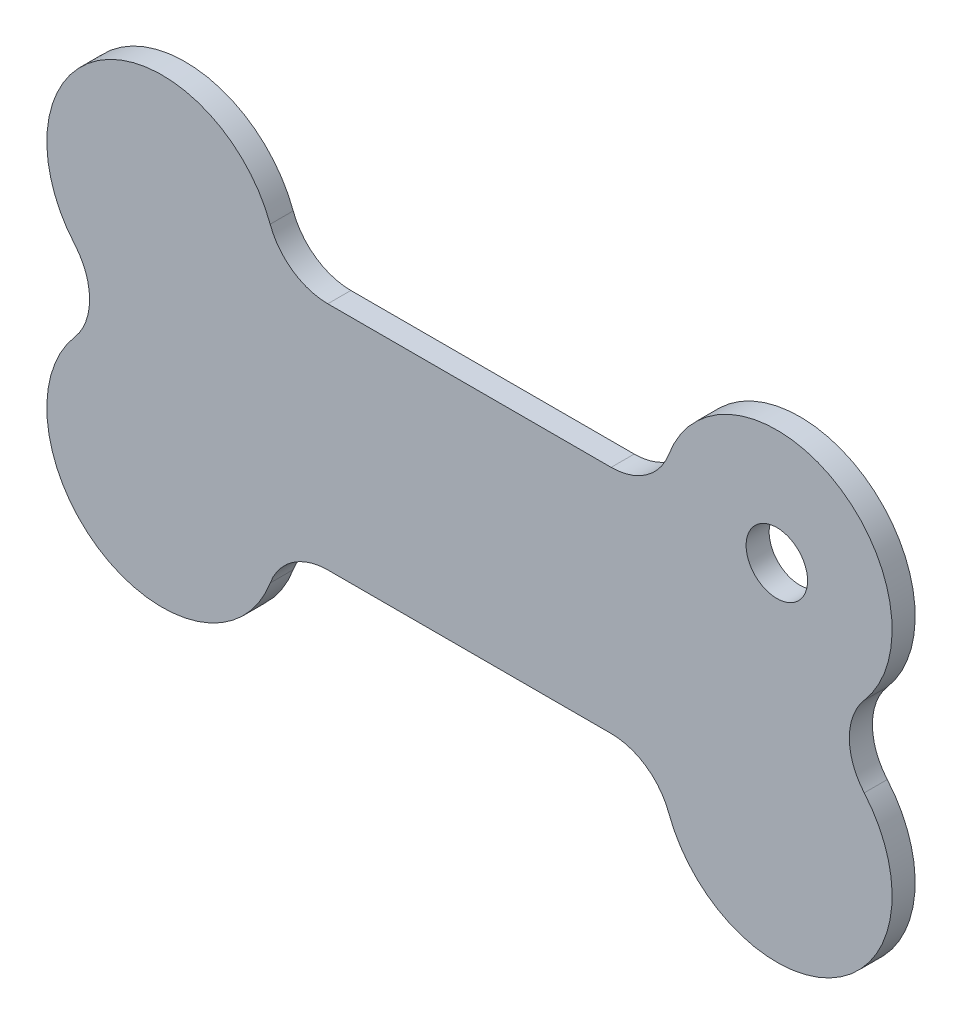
ISO-10303-21;
HEADER;
FILE_DESCRIPTION(('STEP AP214'),'2;1');
FILE_NAME('part.step','',(''),(''),'','','');
FILE_SCHEMA(('AUTOMOTIVE_DESIGN { 1 0 10303 214 1 1 1 1 }'));
ENDSEC;
DATA;
#1=APPLICATION_CONTEXT('core data for automotive mechanical design processes');
#2=APPLICATION_PROTOCOL_DEFINITION('international standard','automotive_design',2000,#1);
#3=PRODUCT_CONTEXT('',#1,'mechanical');
#4=PRODUCT('Part','Part','',(#3));
#5=PRODUCT_RELATED_PRODUCT_CATEGORY('part','',(#4));
#6=PRODUCT_DEFINITION_FORMATION('','',#4);
#7=PRODUCT_DEFINITION_CONTEXT('part definition',#1,'design');
#8=PRODUCT_DEFINITION('design','',#6,#7);
#9=PRODUCT_DEFINITION_SHAPE('','',#8);
#10=(LENGTH_UNIT() NAMED_UNIT(*) SI_UNIT(.MILLI.,.METRE.));
#11=(NAMED_UNIT(*) PLANE_ANGLE_UNIT() SI_UNIT($,.RADIAN.));
#12=(NAMED_UNIT(*) SI_UNIT($,.STERADIAN.) SOLID_ANGLE_UNIT());
#13=UNCERTAINTY_MEASURE_WITH_UNIT(LENGTH_MEASURE(1.E-05),#10,'distance_accuracy_value','');
#14=(GEOMETRIC_REPRESENTATION_CONTEXT(3) GLOBAL_UNCERTAINTY_ASSIGNED_CONTEXT((#13)) GLOBAL_UNIT_ASSIGNED_CONTEXT((#10,
#11,#12)) REPRESENTATION_CONTEXT('',''));
#15=CARTESIAN_POINT('',(0.,0.,0.));
#16=DIRECTION('',(0.,0.,1.));
#17=DIRECTION('',(1.,0.,0.));
#18=AXIS2_PLACEMENT_3D('',#15,#16,#17);
#19=CARTESIAN_POINT('',(-9.21807067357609,11.5,1.5));
#20=DIRECTION('',(0.,0.,-1.));
#21=DIRECTION('',(-1.,0.,0.));
#22=AXIS2_PLACEMENT_3D('',#19,#20,#21);
#23=PLANE('',#22);
#24=CARTESIAN_POINT('',(-9.21807067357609,11.5,1.5));
#25=DIRECTION('',(0.,0.,-1.));
#26=DIRECTION('',(-1.,0.,0.));
#27=AXIS2_PLACEMENT_3D('',#24,#25,#26);
#28=CIRCLE('',#27,4.);
#29=CARTESIAN_POINT('',(-9.21807067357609,7.5,1.5));
#30=VERTEX_POINT('',#29);
#31=CARTESIAN_POINT('',(-12.9683069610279,10.1086956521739,1.5));
#32=VERTEX_POINT('',#31);
#33=EDGE_CURVE('E166',#30,#32,#28,.T.);
#34=ORIENTED_EDGE('',*,*,#33,.T.);
#35=CARTESIAN_POINT('',(-20.,7.5,1.5));
#36=DIRECTION('',(0.,0.,1.));
#37=DIRECTION('',(1.,0.,0.));
#38=AXIS2_PLACEMENT_3D('',#35,#36,#37);
#39=CIRCLE('',#38,7.5);
#40=CARTESIAN_POINT('',(-25.68552036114,2.60869565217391,1.5));
#41=VERTEX_POINT('',#40);
#42=EDGE_CURVE('E135',#32,#41,#39,.T.);
#43=ORIENTED_EDGE('',*,*,#42,.T.);
#44=CARTESIAN_POINT('',(-28.7177978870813,0.,1.5));
#45=DIRECTION('',(0.,0.,-1.));
#46=DIRECTION('',(1.,0.,0.));
#47=AXIS2_PLACEMENT_3D('',#44,#45,#46);
#48=CIRCLE('',#47,4.);
#49=CARTESIAN_POINT('',(-25.68552036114,-2.60869565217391,1.5));
#50=VERTEX_POINT('',#49);
#51=EDGE_CURVE('E169',#41,#50,#48,.T.);
#52=ORIENTED_EDGE('',*,*,#51,.T.);
#53=CARTESIAN_POINT('',(-20.,-7.5,1.5));
#54=DIRECTION('',(0.,0.,1.));
#55=DIRECTION('',(-1.,0.,0.));
#56=AXIS2_PLACEMENT_3D('',#53,#54,#55);
#57=CIRCLE('',#56,7.5);
#58=CARTESIAN_POINT('',(-12.9683069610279,-10.1086956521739,1.5));
#59=VERTEX_POINT('',#58);
#60=EDGE_CURVE('E171',#50,#59,#57,.T.);
#61=ORIENTED_EDGE('',*,*,#60,.T.);
#62=CARTESIAN_POINT('',(-9.21807067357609,-11.5,1.5));
#63=DIRECTION('',(0.,0.,-1.));
#64=DIRECTION('',(1.,0.,0.));
#65=AXIS2_PLACEMENT_3D('',#62,#63,#64);
#66=CIRCLE('',#65,4.);
#67=CARTESIAN_POINT('',(-9.21807067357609,-7.5,1.5));
#68=VERTEX_POINT('',#67);
#69=EDGE_CURVE('E173',#59,#68,#66,.T.);
#70=ORIENTED_EDGE('',*,*,#69,.T.);
#71=DIRECTION('',(1.,0.,0.));
#72=VECTOR('',#71,1.);
#73=CARTESIAN_POINT('',(9.2180706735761,-7.5,1.5));
#74=LINE('',#73,#72);
#75=CARTESIAN_POINT('',(9.2180706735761,-7.5,1.5));
#76=VERTEX_POINT('',#75);
#77=EDGE_CURVE('E175',#68,#76,#74,.T.);
#78=ORIENTED_EDGE('',*,*,#77,.T.);
#79=CARTESIAN_POINT('',(9.2180706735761,-11.5,1.5));
#80=DIRECTION('',(0.,0.,-1.));
#81=DIRECTION('',(-1.,0.,0.));
#82=AXIS2_PLACEMENT_3D('',#79,#80,#81);
#83=CIRCLE('',#82,4.);
#84=CARTESIAN_POINT('',(12.9683069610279,-10.1086956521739,1.5));
#85=VERTEX_POINT('',#84);
#86=EDGE_CURVE('E177',#76,#85,#83,.T.);
#87=ORIENTED_EDGE('',*,*,#86,.T.);
#88=CARTESIAN_POINT('',(20.,-7.49999999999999,1.5));
#89=DIRECTION('',(0.,0.,1.));
#90=DIRECTION('',(1.,0.,0.));
#91=AXIS2_PLACEMENT_3D('',#88,#89,#90);
#92=CIRCLE('',#91,7.5);
#93=CARTESIAN_POINT('',(25.68552036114,-2.60869565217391,1.5));
#94=VERTEX_POINT('',#93);
#95=EDGE_CURVE('E179',#85,#94,#92,.T.);
#96=ORIENTED_EDGE('',*,*,#95,.T.);
#97=CARTESIAN_POINT('',(28.7177978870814,0.,1.5));
#98=DIRECTION('',(0.,0.,-1.));
#99=DIRECTION('',(-1.,0.,0.));
#100=AXIS2_PLACEMENT_3D('',#97,#98,#99);
#101=CIRCLE('',#100,4.);
#102=CARTESIAN_POINT('',(25.68552036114,2.60869565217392,1.5));
#103=VERTEX_POINT('',#102);
#104=EDGE_CURVE('E181',#94,#103,#101,.T.);
#105=ORIENTED_EDGE('',*,*,#104,.T.);
#106=CARTESIAN_POINT('',(20.,7.50000000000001,1.5));
#107=DIRECTION('',(0.,0.,1.));
#108=DIRECTION('',(-1.,0.,0.));
#109=AXIS2_PLACEMENT_3D('',#106,#107,#108);
#110=CIRCLE('',#109,7.5);
#111=CARTESIAN_POINT('',(12.9683069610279,10.1086956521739,1.5));
#112=VERTEX_POINT('',#111);
#113=EDGE_CURVE('E183',#103,#112,#110,.T.);
#114=ORIENTED_EDGE('',*,*,#113,.T.);
#115=CARTESIAN_POINT('',(9.2180706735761,11.5,1.5));
#116=DIRECTION('',(0.,0.,-1.));
#117=DIRECTION('',(1.,0.,0.));
#118=AXIS2_PLACEMENT_3D('',#115,#116,#117);
#119=CIRCLE('',#118,4.);
#120=CARTESIAN_POINT('',(9.2180706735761,7.50000000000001,1.5));
#121=VERTEX_POINT('',#120);
#122=EDGE_CURVE('E52',#112,#121,#119,.T.);
#123=ORIENTED_EDGE('',*,*,#122,.T.);
#124=DIRECTION('',(-1.,0.,0.));
#125=VECTOR('',#124,1.);
#126=CARTESIAN_POINT('',(9.2180706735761,7.50000000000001,1.5));
#127=LINE('',#126,#125);
#128=EDGE_CURVE('E47',#121,#30,#127,.T.);
#129=ORIENTED_EDGE('',*,*,#128,.T.);
#130=EDGE_LOOP('',(#34,#43,#52,#61,#70,#78,#87,#96,#105,#114,#123,#129));
#131=FACE_BOUND('',#130,.T.);
#132=CARTESIAN_POINT('',(20.,7.50000000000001,1.5));
#133=DIRECTION('',(0.,0.,1.));
#134=DIRECTION('',(1.,0.,0.));
#135=AXIS2_PLACEMENT_3D('',#132,#133,#134);
#136=CIRCLE('',#135,2.);
#137=CARTESIAN_POINT('',(22.,7.50000000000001,1.5));
#138=VERTEX_POINT('',#137);
#139=EDGE_CURVE('E140',#138,#138,#136,.T.);
#140=ORIENTED_EDGE('',*,*,#139,.F.);
#141=EDGE_LOOP('',(#140));
#142=FACE_BOUND('',#141,.T.);
#143=ADVANCED_FACE('F32',(#131,#142),#23,.F.);
#144=CARTESIAN_POINT('',(-9.21807067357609,11.5,0.));
#145=DIRECTION('',(0.,0.,-1.));
#146=DIRECTION('',(-1.,0.,0.));
#147=AXIS2_PLACEMENT_3D('',#144,#145,#146);
#148=PLANE('',#147);
#149=CARTESIAN_POINT('',(-9.21807067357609,11.5,0.));
#150=DIRECTION('',(0.,0.,-1.));
#151=DIRECTION('',(-1.,0.,0.));
#152=AXIS2_PLACEMENT_3D('',#149,#150,#151);
#153=CIRCLE('',#152,4.);
#154=CARTESIAN_POINT('',(-9.21807067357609,7.5,0.));
#155=VERTEX_POINT('',#154);
#156=CARTESIAN_POINT('',(-12.9683069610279,10.1086956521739,0.));
#157=VERTEX_POINT('',#156);
#158=EDGE_CURVE('E126',#155,#157,#153,.T.);
#159=ORIENTED_EDGE('',*,*,#158,.F.);
#160=DIRECTION('',(-1.,0.,0.));
#161=VECTOR('',#160,1.);
#162=CARTESIAN_POINT('',(9.2180706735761,7.50000000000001,0.));
#163=LINE('',#162,#161);
#164=CARTESIAN_POINT('',(9.2180706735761,7.50000000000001,0.));
#165=VERTEX_POINT('',#164);
#166=EDGE_CURVE('E164',#165,#155,#163,.T.);
#167=ORIENTED_EDGE('',*,*,#166,.F.);
#168=CARTESIAN_POINT('',(9.2180706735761,11.5,0.));
#169=DIRECTION('',(0.,0.,-1.));
#170=DIRECTION('',(1.,0.,0.));
#171=AXIS2_PLACEMENT_3D('',#168,#169,#170);
#172=CIRCLE('',#171,4.);
#173=CARTESIAN_POINT('',(12.9683069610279,10.1086956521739,0.));
#174=VERTEX_POINT('',#173);
#175=EDGE_CURVE('E162',#174,#165,#172,.T.);
#176=ORIENTED_EDGE('',*,*,#175,.F.);
#177=CARTESIAN_POINT('',(20.,7.50000000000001,0.));
#178=DIRECTION('',(0.,0.,1.));
#179=DIRECTION('',(-1.,0.,0.));
#180=AXIS2_PLACEMENT_3D('',#177,#178,#179);
#181=CIRCLE('',#180,7.5);
#182=CARTESIAN_POINT('',(25.68552036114,2.60869565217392,0.));
#183=VERTEX_POINT('',#182);
#184=EDGE_CURVE('E160',#183,#174,#181,.T.);
#185=ORIENTED_EDGE('',*,*,#184,.F.);
#186=CARTESIAN_POINT('',(28.7177978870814,0.,0.));
#187=DIRECTION('',(0.,0.,-1.));
#188=DIRECTION('',(-1.,0.,0.));
#189=AXIS2_PLACEMENT_3D('',#186,#187,#188);
#190=CIRCLE('',#189,4.);
#191=CARTESIAN_POINT('',(25.68552036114,-2.60869565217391,0.));
#192=VERTEX_POINT('',#191);
#193=EDGE_CURVE('E158',#192,#183,#190,.T.);
#194=ORIENTED_EDGE('',*,*,#193,.F.);
#195=CARTESIAN_POINT('',(20.,-7.49999999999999,0.));
#196=DIRECTION('',(0.,0.,1.));
#197=DIRECTION('',(1.,0.,0.));
#198=AXIS2_PLACEMENT_3D('',#195,#196,#197);
#199=CIRCLE('',#198,7.5);
#200=CARTESIAN_POINT('',(12.9683069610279,-10.1086956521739,0.));
#201=VERTEX_POINT('',#200);
#202=EDGE_CURVE('E156',#201,#192,#199,.T.);
#203=ORIENTED_EDGE('',*,*,#202,.F.);
#204=CARTESIAN_POINT('',(9.2180706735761,-11.5,0.));
#205=DIRECTION('',(0.,0.,-1.));
#206=DIRECTION('',(-1.,0.,0.));
#207=AXIS2_PLACEMENT_3D('',#204,#205,#206);
#208=CIRCLE('',#207,4.);
#209=CARTESIAN_POINT('',(9.2180706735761,-7.5,0.));
#210=VERTEX_POINT('',#209);
#211=EDGE_CURVE('E154',#210,#201,#208,.T.);
#212=ORIENTED_EDGE('',*,*,#211,.F.);
#213=DIRECTION('',(1.,0.,0.));
#214=VECTOR('',#213,1.);
#215=CARTESIAN_POINT('',(9.2180706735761,-7.5,0.));
#216=LINE('',#215,#214);
#217=CARTESIAN_POINT('',(-9.21807067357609,-7.5,0.));
#218=VERTEX_POINT('',#217);
#219=EDGE_CURVE('E152',#218,#210,#216,.T.);
#220=ORIENTED_EDGE('',*,*,#219,.F.);
#221=CARTESIAN_POINT('',(-9.21807067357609,-11.5,0.));
#222=DIRECTION('',(0.,0.,-1.));
#223=DIRECTION('',(1.,0.,0.));
#224=AXIS2_PLACEMENT_3D('',#221,#222,#223);
#225=CIRCLE('',#224,4.);
#226=CARTESIAN_POINT('',(-12.9683069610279,-10.1086956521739,0.));
#227=VERTEX_POINT('',#226);
#228=EDGE_CURVE('E150',#227,#218,#225,.T.);
#229=ORIENTED_EDGE('',*,*,#228,.F.);
#230=CARTESIAN_POINT('',(-20.,-7.5,0.));
#231=DIRECTION('',(0.,0.,1.));
#232=DIRECTION('',(-1.,0.,0.));
#233=AXIS2_PLACEMENT_3D('',#230,#231,#232);
#234=CIRCLE('',#233,7.5);
#235=CARTESIAN_POINT('',(-25.68552036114,-2.60869565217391,0.));
#236=VERTEX_POINT('',#235);
#237=EDGE_CURVE('E148',#236,#227,#234,.T.);
#238=ORIENTED_EDGE('',*,*,#237,.F.);
#239=CARTESIAN_POINT('',(-28.7177978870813,0.,0.));
#240=DIRECTION('',(0.,0.,-1.));
#241=DIRECTION('',(1.,0.,0.));
#242=AXIS2_PLACEMENT_3D('',#239,#240,#241);
#243=CIRCLE('',#242,4.);
#244=CARTESIAN_POINT('',(-25.68552036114,2.60869565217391,0.));
#245=VERTEX_POINT('',#244);
#246=EDGE_CURVE('E128',#245,#236,#243,.T.);
#247=ORIENTED_EDGE('',*,*,#246,.F.);
#248=CARTESIAN_POINT('',(-20.,7.5,0.));
#249=DIRECTION('',(0.,0.,1.));
#250=DIRECTION('',(1.,0.,0.));
#251=AXIS2_PLACEMENT_3D('',#248,#249,#250);
#252=CIRCLE('',#251,7.5);
#253=EDGE_CURVE('E121',#157,#245,#252,.T.);
#254=ORIENTED_EDGE('',*,*,#253,.F.);
#255=EDGE_LOOP('',(#159,#167,#176,#185,#194,#203,#212,#220,#229,#238,#247,#254));
#256=FACE_BOUND('',#255,.T.);
#257=CARTESIAN_POINT('',(20.,7.50000000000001,0.));
#258=DIRECTION('',(0.,0.,1.));
#259=DIRECTION('',(1.,0.,0.));
#260=AXIS2_PLACEMENT_3D('',#257,#258,#259);
#261=CIRCLE('',#260,2.);
#262=CARTESIAN_POINT('',(22.,7.50000000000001,0.));
#263=VERTEX_POINT('',#262);
#264=EDGE_CURVE('E143',#263,#263,#261,.T.);
#265=ORIENTED_EDGE('',*,*,#264,.T.);
#266=EDGE_LOOP('',(#265));
#267=FACE_BOUND('',#266,.T.);
#268=ADVANCED_FACE('F122',(#256,#267),#148,.T.);
#269=CARTESIAN_POINT('',(-9.21807067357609,11.5,1.5));
#270=DIRECTION('',(0.,0.,-1.));
#271=DIRECTION('',(-1.,0.,0.));
#272=AXIS2_PLACEMENT_3D('',#269,#270,#271);
#273=CYLINDRICAL_SURFACE('',#272,4.);
#274=ORIENTED_EDGE('',*,*,#158,.T.);
#275=DIRECTION('',(0.,0.,-1.));
#276=VECTOR('',#275,1.);
#277=CARTESIAN_POINT('',(-12.9683069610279,10.1086956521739,1.5));
#278=LINE('',#277,#276);
#279=EDGE_CURVE('E11',#32,#157,#278,.T.);
#280=ORIENTED_EDGE('',*,*,#279,.F.);
#281=ORIENTED_EDGE('',*,*,#33,.F.);
#282=DIRECTION('',(0.,0.,-1.));
#283=VECTOR('',#282,1.);
#284=CARTESIAN_POINT('',(-9.21807067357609,7.5,1.5));
#285=LINE('',#284,#283);
#286=EDGE_CURVE('E139',#30,#155,#285,.T.);
#287=ORIENTED_EDGE('',*,*,#286,.T.);
#288=EDGE_LOOP('',(#274,#280,#281,#287));
#289=FACE_BOUND('',#288,.T.);
#290=ADVANCED_FACE('F34',(#289),#273,.F.);
#291=CARTESIAN_POINT('',(-20.,7.5,1.5));
#292=DIRECTION('',(0.,0.,-1.));
#293=DIRECTION('',(-1.,0.,0.));
#294=AXIS2_PLACEMENT_3D('',#291,#292,#293);
#295=CYLINDRICAL_SURFACE('',#294,7.5);
#296=ORIENTED_EDGE('',*,*,#253,.T.);
#297=DIRECTION('',(0.,0.,-1.));
#298=VECTOR('',#297,1.);
#299=CARTESIAN_POINT('',(-25.68552036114,2.60869565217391,1.5));
#300=LINE('',#299,#298);
#301=EDGE_CURVE('E40',#41,#245,#300,.T.);
#302=ORIENTED_EDGE('',*,*,#301,.F.);
#303=ORIENTED_EDGE('',*,*,#42,.F.);
#304=ORIENTED_EDGE('',*,*,#279,.T.);
#305=EDGE_LOOP('',(#296,#302,#303,#304));
#306=FACE_BOUND('',#305,.T.);
#307=ADVANCED_FACE('F134',(#306),#295,.T.);
#308=CARTESIAN_POINT('',(-28.7177978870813,0.,1.5));
#309=DIRECTION('',(0.,0.,-1.));
#310=DIRECTION('',(-1.,0.,0.));
#311=AXIS2_PLACEMENT_3D('',#308,#309,#310);
#312=CYLINDRICAL_SURFACE('',#311,4.);
#313=ORIENTED_EDGE('',*,*,#246,.T.);
#314=DIRECTION('',(0.,0.,-1.));
#315=VECTOR('',#314,1.);
#316=CARTESIAN_POINT('',(-25.68552036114,-2.60869565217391,1.5));
#317=LINE('',#316,#315);
#318=EDGE_CURVE('E212',#50,#236,#317,.T.);
#319=ORIENTED_EDGE('',*,*,#318,.F.);
#320=ORIENTED_EDGE('',*,*,#51,.F.);
#321=ORIENTED_EDGE('',*,*,#301,.T.);
#322=EDGE_LOOP('',(#313,#319,#320,#321));
#323=FACE_BOUND('',#322,.T.);
#324=ADVANCED_FACE('F216',(#323),#312,.F.);
#325=CARTESIAN_POINT('',(-20.,-7.5,1.5));
#326=DIRECTION('',(0.,0.,-1.));
#327=DIRECTION('',(-1.,0.,0.));
#328=AXIS2_PLACEMENT_3D('',#325,#326,#327);
#329=CYLINDRICAL_SURFACE('',#328,7.5);
#330=ORIENTED_EDGE('',*,*,#237,.T.);
#331=DIRECTION('',(0.,0.,-1.));
#332=VECTOR('',#331,1.);
#333=CARTESIAN_POINT('',(-12.9683069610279,-10.1086956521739,1.5));
#334=LINE('',#333,#332);
#335=EDGE_CURVE('E209',#59,#227,#334,.T.);
#336=ORIENTED_EDGE('',*,*,#335,.F.);
#337=ORIENTED_EDGE('',*,*,#60,.F.);
#338=ORIENTED_EDGE('',*,*,#318,.T.);
#339=EDGE_LOOP('',(#330,#336,#337,#338));
#340=FACE_BOUND('',#339,.T.);
#341=ADVANCED_FACE('F224',(#340),#329,.T.);
#342=CARTESIAN_POINT('',(-9.21807067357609,-11.5,1.5));
#343=DIRECTION('',(0.,0.,-1.));
#344=DIRECTION('',(-1.,0.,0.));
#345=AXIS2_PLACEMENT_3D('',#342,#343,#344);
#346=CYLINDRICAL_SURFACE('',#345,4.);
#347=ORIENTED_EDGE('',*,*,#228,.T.);
#348=DIRECTION('',(0.,0.,-1.));
#349=VECTOR('',#348,1.);
#350=CARTESIAN_POINT('',(-9.21807067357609,-7.5,1.5));
#351=LINE('',#350,#349);
#352=EDGE_CURVE('E206',#68,#218,#351,.T.);
#353=ORIENTED_EDGE('',*,*,#352,.F.);
#354=ORIENTED_EDGE('',*,*,#69,.F.);
#355=ORIENTED_EDGE('',*,*,#335,.T.);
#356=EDGE_LOOP('',(#347,#353,#354,#355));
#357=FACE_BOUND('',#356,.T.);
#358=ADVANCED_FACE('F227',(#357),#346,.F.);
#359=CARTESIAN_POINT('',(9.2180706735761,-7.5,1.5));
#360=DIRECTION('',(0.,1.,0.));
#361=DIRECTION('',(-1.,0.,0.));
#362=AXIS2_PLACEMENT_3D('',#359,#360,#361);
#363=PLANE('',#362);
#364=ORIENTED_EDGE('',*,*,#219,.T.);
#365=DIRECTION('',(0.,0.,-1.));
#366=VECTOR('',#365,1.);
#367=CARTESIAN_POINT('',(9.2180706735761,-7.5,1.5));
#368=LINE('',#367,#366);
#369=EDGE_CURVE('E203',#76,#210,#368,.T.);
#370=ORIENTED_EDGE('',*,*,#369,.F.);
#371=ORIENTED_EDGE('',*,*,#77,.F.);
#372=ORIENTED_EDGE('',*,*,#352,.T.);
#373=EDGE_LOOP('',(#364,#370,#371,#372));
#374=FACE_BOUND('',#373,.T.);
#375=ADVANCED_FACE('F232',(#374),#363,.F.);
#376=CARTESIAN_POINT('',(9.2180706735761,-11.5,1.5));
#377=DIRECTION('',(0.,0.,-1.));
#378=DIRECTION('',(-1.,0.,0.));
#379=AXIS2_PLACEMENT_3D('',#376,#377,#378);
#380=CYLINDRICAL_SURFACE('',#379,4.);
#381=ORIENTED_EDGE('',*,*,#211,.T.);
#382=DIRECTION('',(0.,0.,-1.));
#383=VECTOR('',#382,1.);
#384=CARTESIAN_POINT('',(12.9683069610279,-10.1086956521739,1.5));
#385=LINE('',#384,#383);
#386=EDGE_CURVE('E200',#85,#201,#385,.T.);
#387=ORIENTED_EDGE('',*,*,#386,.F.);
#388=ORIENTED_EDGE('',*,*,#86,.F.);
#389=ORIENTED_EDGE('',*,*,#369,.T.);
#390=EDGE_LOOP('',(#381,#387,#388,#389));
#391=FACE_BOUND('',#390,.T.);
#392=ADVANCED_FACE('F238',(#391),#380,.F.);
#393=CARTESIAN_POINT('',(20.,-7.49999999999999,1.5));
#394=DIRECTION('',(0.,0.,-1.));
#395=DIRECTION('',(-1.,0.,0.));
#396=AXIS2_PLACEMENT_3D('',#393,#394,#395);
#397=CYLINDRICAL_SURFACE('',#396,7.5);
#398=ORIENTED_EDGE('',*,*,#202,.T.);
#399=DIRECTION('',(0.,0.,-1.));
#400=VECTOR('',#399,1.);
#401=CARTESIAN_POINT('',(25.68552036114,-2.60869565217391,1.5));
#402=LINE('',#401,#400);
#403=EDGE_CURVE('E197',#94,#192,#402,.T.);
#404=ORIENTED_EDGE('',*,*,#403,.F.);
#405=ORIENTED_EDGE('',*,*,#95,.F.);
#406=ORIENTED_EDGE('',*,*,#386,.T.);
#407=EDGE_LOOP('',(#398,#404,#405,#406));
#408=FACE_BOUND('',#407,.T.);
#409=ADVANCED_FACE('F242',(#408),#397,.T.);
#410=CARTESIAN_POINT('',(28.7177978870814,0.,1.5));
#411=DIRECTION('',(0.,0.,-1.));
#412=DIRECTION('',(-1.,0.,0.));
#413=AXIS2_PLACEMENT_3D('',#410,#411,#412);
#414=CYLINDRICAL_SURFACE('',#413,4.);
#415=ORIENTED_EDGE('',*,*,#193,.T.);
#416=DIRECTION('',(0.,0.,-1.));
#417=VECTOR('',#416,1.);
#418=CARTESIAN_POINT('',(25.68552036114,2.60869565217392,1.5));
#419=LINE('',#418,#417);
#420=EDGE_CURVE('E194',#103,#183,#419,.T.);
#421=ORIENTED_EDGE('',*,*,#420,.F.);
#422=ORIENTED_EDGE('',*,*,#104,.F.);
#423=ORIENTED_EDGE('',*,*,#403,.T.);
#424=EDGE_LOOP('',(#415,#421,#422,#423));
#425=FACE_BOUND('',#424,.T.);
#426=ADVANCED_FACE('F247',(#425),#414,.F.);
#427=CARTESIAN_POINT('',(20.,7.50000000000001,1.5));
#428=DIRECTION('',(0.,0.,-1.));
#429=DIRECTION('',(-1.,0.,0.));
#430=AXIS2_PLACEMENT_3D('',#427,#428,#429);
#431=CYLINDRICAL_SURFACE('',#430,7.5);
#432=ORIENTED_EDGE('',*,*,#184,.T.);
#433=DIRECTION('',(0.,0.,-1.));
#434=VECTOR('',#433,1.);
#435=CARTESIAN_POINT('',(12.9683069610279,10.1086956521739,1.5));
#436=LINE('',#435,#434);
#437=EDGE_CURVE('E191',#112,#174,#436,.T.);
#438=ORIENTED_EDGE('',*,*,#437,.F.);
#439=ORIENTED_EDGE('',*,*,#113,.F.);
#440=ORIENTED_EDGE('',*,*,#420,.T.);
#441=EDGE_LOOP('',(#432,#438,#439,#440));
#442=FACE_BOUND('',#441,.T.);
#443=ADVANCED_FACE('F251',(#442),#431,.T.);
#444=CARTESIAN_POINT('',(9.2180706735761,11.5,1.5));
#445=DIRECTION('',(0.,0.,-1.));
#446=DIRECTION('',(-1.,0.,0.));
#447=AXIS2_PLACEMENT_3D('',#444,#445,#446);
#448=CYLINDRICAL_SURFACE('',#447,4.);
#449=ORIENTED_EDGE('',*,*,#175,.T.);
#450=DIRECTION('',(0.,0.,-1.));
#451=VECTOR('',#450,1.);
#452=CARTESIAN_POINT('',(9.2180706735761,7.50000000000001,1.5));
#453=LINE('',#452,#451);
#454=EDGE_CURVE('E188',#121,#165,#453,.T.);
#455=ORIENTED_EDGE('',*,*,#454,.F.);
#456=ORIENTED_EDGE('',*,*,#122,.F.);
#457=ORIENTED_EDGE('',*,*,#437,.T.);
#458=EDGE_LOOP('',(#449,#455,#456,#457));
#459=FACE_BOUND('',#458,.T.);
#460=ADVANCED_FACE('F255',(#459),#448,.F.);
#461=CARTESIAN_POINT('',(9.2180706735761,7.50000000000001,1.5));
#462=DIRECTION('',(0.,-1.,0.));
#463=DIRECTION('',(1.,0.,0.));
#464=AXIS2_PLACEMENT_3D('',#461,#462,#463);
#465=PLANE('',#464);
#466=ORIENTED_EDGE('',*,*,#166,.T.);
#467=ORIENTED_EDGE('',*,*,#286,.F.);
#468=ORIENTED_EDGE('',*,*,#128,.F.);
#469=ORIENTED_EDGE('',*,*,#454,.T.);
#470=EDGE_LOOP('',(#466,#467,#468,#469));
#471=FACE_BOUND('',#470,.T.);
#472=ADVANCED_FACE('F257',(#471),#465,.F.);
#473=CARTESIAN_POINT('',(20.,7.50000000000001,1.5));
#474=DIRECTION('',(0.,0.,-1.));
#475=DIRECTION('',(-1.,0.,0.));
#476=AXIS2_PLACEMENT_3D('',#473,#474,#475);
#477=CYLINDRICAL_SURFACE('',#476,2.);
#478=ORIENTED_EDGE('',*,*,#139,.T.);
#479=EDGE_LOOP('',(#478));
#480=FACE_BOUND('',#479,.T.);
#481=ORIENTED_EDGE('',*,*,#264,.F.);
#482=EDGE_LOOP('',(#481));
#483=FACE_BOUND('',#482,.T.);
#484=ADVANCED_FACE('F259',(#480,#483),#477,.F.);
#485=CLOSED_SHELL('',(#143,#268,#290,#307,#324,#341,#358,#375,#392,#409,#426,#443,#460,#472,#484));
#486=MANIFOLD_SOLID_BREP('B2',#485);
#487=ADVANCED_BREP_SHAPE_REPRESENTATION('',(#18,#486),#14);
#488=SHAPE_DEFINITION_REPRESENTATION(#9,#487);
ENDSEC;
END-ISO-10303-21;
